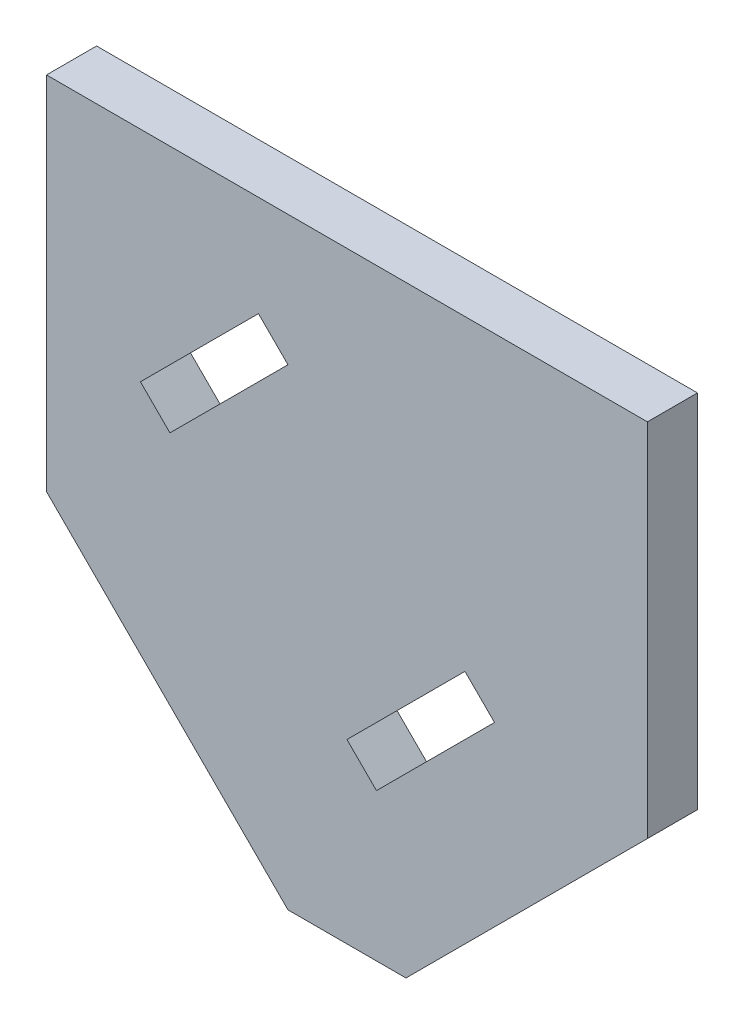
from build123d import *

# Parameters (mm, degrees)
BOSS_EXTRUDE1_DEPTH = 3
CUT_EXTRUDE1_DEPTH  = 29.296071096
CHAMFER1_SIZE       = 5


with BuildPart() as part:
    # Sketch1 → Boss-Extrude1 (new body)
    with BuildSketch(Plane.XY):
        Polygon((-18, 21.625624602), (0, 21.625624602), (18, 21.625624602), (18, 0), (0, -18), (-18, 0), align=None)
    extrude(amount=BOSS_EXTRUDE1_DEPTH)

    # Sketch2 → Cut-Extrude1 (cut, through all)
    with BuildSketch(Plane.XY.offset(3)):
        Polygon((8.838834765, 1.445436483), (1.767766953, -5.625631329), (0, -3.857864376), (7.071067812, 3.213203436), align=None)
        Polygon((-12.374368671, 8.516504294), (-5.303300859, 15.587572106), (-3.535533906, 13.819805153), (-10.606601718, 6.748737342), align=None)
    extrude(amount=-CUT_EXTRUDE1_DEPTH, mode=Mode.SUBTRACT)

    # Chamfer1
    chamfer1_edges = [part.edges().sort_by_distance(p)[0] for p in [
        (0, -18, 1.5),
    ]]
    chamfer(chamfer1_edges, length=CHAMFER1_SIZE)


solid = part.part
